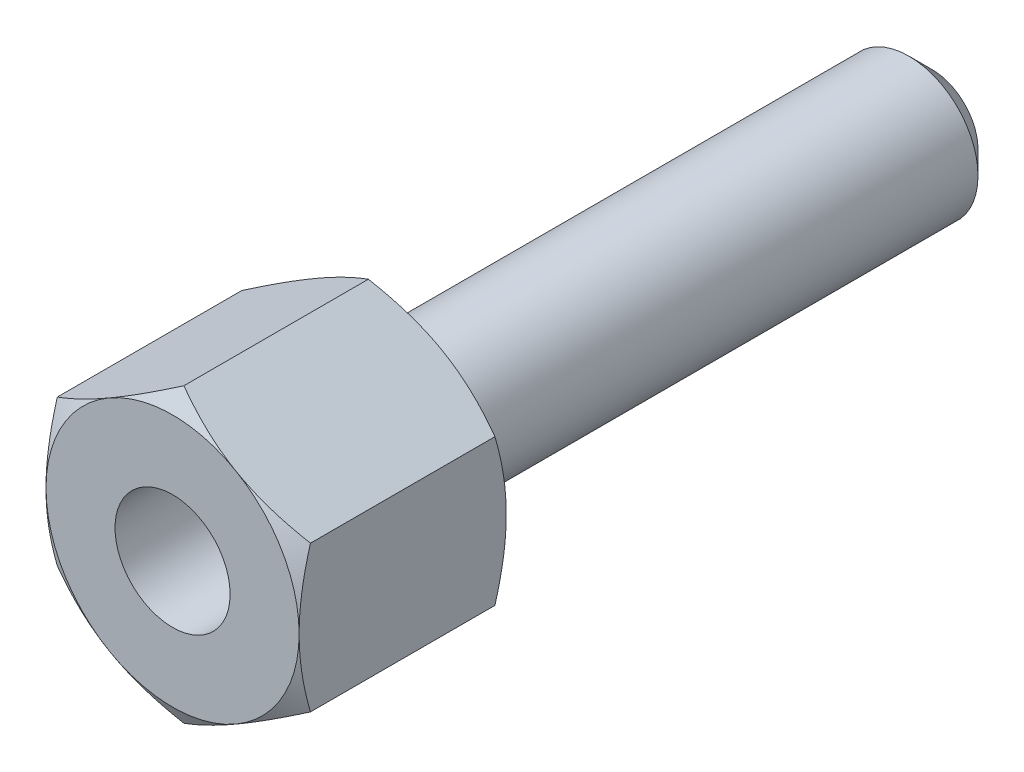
ISO-10303-21;
HEADER;
FILE_DESCRIPTION(('STEP AP214'),'2;1');
FILE_NAME('part.step','',(''),(''),'','','');
FILE_SCHEMA(('AUTOMOTIVE_DESIGN { 1 0 10303 214 1 1 1 1 }'));
ENDSEC;
DATA;
#1=APPLICATION_CONTEXT('core data for automotive mechanical design processes');
#2=APPLICATION_PROTOCOL_DEFINITION('international standard','automotive_design',2000,#1);
#3=PRODUCT_CONTEXT('',#1,'mechanical');
#4=PRODUCT('Part','Part','',(#3));
#5=PRODUCT_RELATED_PRODUCT_CATEGORY('part','',(#4));
#6=PRODUCT_DEFINITION_FORMATION('','',#4);
#7=PRODUCT_DEFINITION_CONTEXT('part definition',#1,'design');
#8=PRODUCT_DEFINITION('design','',#6,#7);
#9=PRODUCT_DEFINITION_SHAPE('','',#8);
#10=(LENGTH_UNIT() NAMED_UNIT(*) SI_UNIT(.MILLI.,.METRE.));
#11=(NAMED_UNIT(*) PLANE_ANGLE_UNIT() SI_UNIT($,.RADIAN.));
#12=(NAMED_UNIT(*) SI_UNIT($,.STERADIAN.) SOLID_ANGLE_UNIT());
#13=UNCERTAINTY_MEASURE_WITH_UNIT(LENGTH_MEASURE(1.E-05),#10,'distance_accuracy_value','');
#14=(GEOMETRIC_REPRESENTATION_CONTEXT(3) GLOBAL_UNCERTAINTY_ASSIGNED_CONTEXT((#13)) GLOBAL_UNIT_ASSIGNED_CONTEXT((#10,
#11,#12)) REPRESENTATION_CONTEXT('',''));
#15=CARTESIAN_POINT('',(0.,0.,0.));
#16=DIRECTION('',(0.,0.,1.));
#17=DIRECTION('',(1.,0.,0.));
#18=AXIS2_PLACEMENT_3D('',#15,#16,#17);
#19=CARTESIAN_POINT('',(11.,-6.35085296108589,18.));
#20=DIRECTION('',(-1.,0.,0.));
#21=DIRECTION('',(0.,0.,1.));
#22=AXIS2_PLACEMENT_3D('',#19,#20,#21);
#23=PLANE('',#22);
#24=CARTESIAN_POINT('',(11.,-17.0756488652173,5.37629196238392));
#25=CARTESIAN_POINT('',(11.,-16.8353326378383,5.25965447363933));
#26=CARTESIAN_POINT('',(11.,-16.5947348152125,5.14359745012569));
#27=CARTESIAN_POINT('',(11.,-16.112917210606,4.91277578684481));
#28=CARTESIAN_POINT('',(11.,-15.8716974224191,4.7980111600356));
#29=CARTESIAN_POINT('',(11.,-15.1469529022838,4.45582289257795));
#30=CARTESIAN_POINT('',(11.,-14.6624138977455,4.23053936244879));
#31=CARTESIAN_POINT('',(11.,-13.6874699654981,3.78582985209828));
#32=CARTESIAN_POINT('',(11.,-13.1970474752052,3.56644228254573));
#33=CARTESIAN_POINT('',(11.,-12.2123072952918,3.13662191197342));
#34=CARTESIAN_POINT('',(11.,-11.7179897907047,2.92618868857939));
#35=CARTESIAN_POINT('',(11.,-10.7087976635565,2.51010110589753));
#36=CARTESIAN_POINT('',(11.,-10.1937707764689,2.30481413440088));
#37=CARTESIAN_POINT('',(11.,-9.15769444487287,1.90973648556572));
#38=CARTESIAN_POINT('',(11.,-8.63664433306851,1.71994754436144));
#39=CARTESIAN_POINT('',(11.,-7.5886787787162,1.36083798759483));
#40=CARTESIAN_POINT('',(11.,-7.0617775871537,1.1914761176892));
#41=CARTESIAN_POINT('',(11.,-6.00036808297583,0.878634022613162));
#42=CARTESIAN_POINT('',(11.,-5.46586221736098,0.735145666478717));
#43=CARTESIAN_POINT('',(11.,-4.65974627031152,0.544884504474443));
#44=CARTESIAN_POINT('',(11.,-4.39103609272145,0.485750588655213));
#45=CARTESIAN_POINT('',(11.,-3.85177657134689,0.376514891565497));
#46=CARTESIAN_POINT('',(11.,-3.58122726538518,0.326412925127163));
#47=CARTESIAN_POINT('',(11.,-3.03847555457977,0.236124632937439));
#48=CARTESIAN_POINT('',(11.,-2.76627317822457,0.195938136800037));
#49=CARTESIAN_POINT('',(11.,-2.22050177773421,0.126281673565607));
#50=CARTESIAN_POINT('',(11.,-1.94693280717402,0.0968112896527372));
#51=CARTESIAN_POINT('',(11.,-1.40239199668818,0.0495431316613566));
#52=CARTESIAN_POINT('',(11.,-1.13143306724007,0.031597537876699));
#53=CARTESIAN_POINT('',(11.,-0.588999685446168,0.00718173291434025));
#54=CARTESIAN_POINT('',(11.,-0.31752524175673,0.000711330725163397));
#55=CARTESIAN_POINT('',(11.,0.225456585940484,-0.00060010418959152));
#56=CARTESIAN_POINT('',(11.,0.496963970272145,0.00455898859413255));
#57=CARTESIAN_POINT('',(11.,1.03951918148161,0.026380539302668));
#58=CARTESIAN_POINT('',(11.,1.31056698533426,0.0430435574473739));
#59=CARTESIAN_POINT('',(11.,1.96135383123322,0.0965093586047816));
#60=CARTESIAN_POINT('',(11.,2.34065675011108,0.138735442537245));
#61=CARTESIAN_POINT('',(11.,3.09644148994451,0.243416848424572));
#62=CARTESIAN_POINT('',(11.,3.47292292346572,0.305874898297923));
#63=CARTESIAN_POINT('',(11.,4.59769776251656,0.520284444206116));
#64=CARTESIAN_POINT('',(11.,5.34091254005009,0.699233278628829));
#65=CARTESIAN_POINT('',(11.,6.45248613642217,1.00953791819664));
#66=CARTESIAN_POINT('',(11.,6.82660667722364,1.12143981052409));
#67=CARTESIAN_POINT('',(11.,7.57121266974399,1.35685428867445));
#68=CARTESIAN_POINT('',(11.,7.94169809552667,1.48036695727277));
#69=CARTESIAN_POINT('',(11.,8.67915388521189,1.73702174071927));
#70=CARTESIAN_POINT('',(11.,9.04612534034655,1.87016074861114));
#71=CARTESIAN_POINT('',(11.,9.77702505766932,2.14450246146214));
#72=CARTESIAN_POINT('',(11.,10.1409533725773,2.28570502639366));
#73=CARTESIAN_POINT('',(11.,11.0667675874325,2.65483102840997));
#74=CARTESIAN_POINT('',(11.,11.6267570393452,2.88750481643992));
#75=CARTESIAN_POINT('',(11.,12.7414587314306,3.365207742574));
#76=CARTESIAN_POINT('',(11.,13.296170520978,3.61023792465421));
#77=CARTESIAN_POINT('',(11.,14.4014324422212,4.10991707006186));
#78=CARTESIAN_POINT('',(11.,14.9519812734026,4.36456890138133));
#79=CARTESIAN_POINT('',(11.,16.0495309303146,4.88134280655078));
#80=CARTESIAN_POINT('',(11.,16.5965318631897,5.14346465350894));
#81=CARTESIAN_POINT('',(11.,17.6883745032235,5.67400461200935));
#82=CARTESIAN_POINT('',(11.,18.2332123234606,5.94243070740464));
#83=CARTESIAN_POINT('',(11.,19.3205002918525,6.48407680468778));
#84=CARTESIAN_POINT('',(11.,19.8629504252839,6.75729683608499));
#85=CARTESIAN_POINT('',(11.,20.9457713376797,7.3075919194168));
#86=CARTESIAN_POINT('',(11.,21.4861424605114,7.58466629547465));
#87=CARTESIAN_POINT('',(11.,22.5652230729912,8.14203379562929));
#88=CARTESIAN_POINT('',(11.,23.1039325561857,8.42232693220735));
#89=CARTESIAN_POINT('',(11.,24.6148934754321,9.21324961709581));
#90=CARTESIAN_POINT('',(11.,25.5855608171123,9.72690499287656));
#91=CARTESIAN_POINT('',(11.,27.5235301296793,10.7606219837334));
#92=CARTESIAN_POINT('',(11.,28.490831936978,11.2806839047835));
#93=CARTESIAN_POINT('',(11.,30.4200227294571,12.3241238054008));
#94=CARTESIAN_POINT('',(11.,31.3819192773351,12.8474878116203));
#95=CARTESIAN_POINT('',(11.,32.823208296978,13.6353023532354));
#96=CARTESIAN_POINT('',(11.,33.3033631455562,13.8983600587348));
#97=CARTESIAN_POINT('',(11.,34.263217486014,14.4253034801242));
#98=CARTESIAN_POINT('',(11.,34.7429169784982,14.6891891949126));
#99=CARTESIAN_POINT('',(11.,35.2224158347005,14.9534390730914));
#100=B_SPLINE_CURVE_WITH_KNOTS('',3,(#24,#25,#26,#27,#28,#29,#30,#31,#32,#33,#34,#35,#36,#37,
#38,#39,#40,#41,#42,#43,#44,#45,#46,#47,#48,#49,#50,#51,#52,#53,#54,#55,#56,#57,#58,#59,#60,#61,
#62,#63,#64,#65,#66,#67,#68,#69,#70,#71,#72,#73,#74,#75,#76,#77,#78,#79,#80,#81,#82,#83,#84,#85,
#86,#87,#88,#89,#90,#91,#92,#93,#94,#95,#96,#97,#98,#99),.UNSPECIFIED.,.F.,.F.,(4,2,2,2,2,2,2,2,
2,2,2,2,2,2,2,2,2,2,2,2,2,2,2,2,2,2,2,2,2,2,2,2,2,2,2,2,2,4),(0.,0.801375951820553,
1.60275993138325,3.20576437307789,4.81746573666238,6.42909099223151,8.09219815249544,
9.75549136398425,11.4153670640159,13.0747202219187,13.9000127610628,14.7252883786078,
15.5505498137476,16.3757791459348,17.1902005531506,18.0046084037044,18.8190250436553,
19.6334813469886,20.7777737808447,21.9222205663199,24.2123414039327,25.3837356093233,
26.5551381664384,27.7261643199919,28.8971701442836,30.7161680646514,32.5353199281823,
34.3550183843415,36.1746616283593,37.9967488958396,39.818847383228,41.6406302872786,
43.4624202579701,46.7569746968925,50.0516870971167,53.3368536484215,54.9793305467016,
56.6218052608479),.UNSPECIFIED.);
#101=CARTESIAN_POINT('',(11.,6.35085296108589,0.982480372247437));
#102=VERTEX_POINT('',#101);
#103=CARTESIAN_POINT('',(11.,0.,0.));
#104=VERTEX_POINT('',#103);
#105=EDGE_CURVE('E102',#102,#104,#100,.F.);
#106=ORIENTED_EDGE('',*,*,#105,.F.);
#107=DIRECTION('',(0.,0.,-1.));
#108=VECTOR('',#107,1.);
#109=CARTESIAN_POINT('',(11.,6.35085296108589,18.));
#110=LINE('',#109,#108);
#111=CARTESIAN_POINT('',(11.,6.35085296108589,17.0175196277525));
#112=VERTEX_POINT('',#111);
#113=EDGE_CURVE('E323',#112,#102,#110,.T.);
#114=ORIENTED_EDGE('',*,*,#113,.F.);
#115=CARTESIAN_POINT('',(11.,-17.0756488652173,12.6237080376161));
#116=CARTESIAN_POINT('',(11.,-16.8353326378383,12.7403455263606));
#117=CARTESIAN_POINT('',(11.,-16.5947348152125,12.8564025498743));
#118=CARTESIAN_POINT('',(11.,-16.112917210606,13.0872242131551));
#119=CARTESIAN_POINT('',(11.,-15.8716974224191,13.2019888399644));
#120=CARTESIAN_POINT('',(11.,-15.1469529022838,13.544177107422));
#121=CARTESIAN_POINT('',(11.,-14.6624138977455,13.7694606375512));
#122=CARTESIAN_POINT('',(11.,-13.6874699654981,14.2141701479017));
#123=CARTESIAN_POINT('',(11.,-13.1970474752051,14.4335577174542));
#124=CARTESIAN_POINT('',(11.,-12.2123072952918,14.8633780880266));
#125=CARTESIAN_POINT('',(11.,-11.7179897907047,15.0738113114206));
#126=CARTESIAN_POINT('',(11.,-10.7087976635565,15.4898988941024));
#127=CARTESIAN_POINT('',(11.,-10.1937707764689,15.6951858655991));
#128=CARTESIAN_POINT('',(11.,-9.15769444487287,16.0902635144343));
#129=CARTESIAN_POINT('',(11.,-8.6366443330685,16.2800524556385));
#130=CARTESIAN_POINT('',(11.,-7.5886787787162,16.6391620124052));
#131=CARTESIAN_POINT('',(11.,-7.0617775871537,16.8085238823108));
#132=CARTESIAN_POINT('',(11.,-6.00036808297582,17.1213659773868));
#133=CARTESIAN_POINT('',(11.,-5.46586221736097,17.2648543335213));
#134=CARTESIAN_POINT('',(11.,-4.65974627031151,17.4551154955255));
#135=CARTESIAN_POINT('',(11.,-4.39103609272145,17.5142494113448));
#136=CARTESIAN_POINT('',(11.,-3.85177657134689,17.6234851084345));
#137=CARTESIAN_POINT('',(11.,-3.58122726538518,17.6735870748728));
#138=CARTESIAN_POINT('',(11.,-3.03847555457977,17.7638753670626));
#139=CARTESIAN_POINT('',(11.,-2.76627317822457,17.8040618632));
#140=CARTESIAN_POINT('',(11.,-2.2205017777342,17.8737183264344));
#141=CARTESIAN_POINT('',(11.,-1.94693280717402,17.9031887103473));
#142=CARTESIAN_POINT('',(11.,-1.40239199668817,17.9504568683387));
#143=CARTESIAN_POINT('',(11.,-1.13143306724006,17.9684024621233));
#144=CARTESIAN_POINT('',(11.,-0.588999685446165,17.9928182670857));
#145=CARTESIAN_POINT('',(11.,-0.317525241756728,17.9992886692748));
#146=CARTESIAN_POINT('',(11.,0.225456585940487,18.0006001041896));
#147=CARTESIAN_POINT('',(11.,0.496963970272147,17.9954410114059));
#148=CARTESIAN_POINT('',(11.,1.03951918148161,17.9736194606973));
#149=CARTESIAN_POINT('',(11.,1.31056698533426,17.9569564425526));
#150=CARTESIAN_POINT('',(11.,1.96135383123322,17.9034906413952));
#151=CARTESIAN_POINT('',(11.,2.34065675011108,17.8612645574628));
#152=CARTESIAN_POINT('',(11.,3.0964414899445,17.7565831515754));
#153=CARTESIAN_POINT('',(11.,3.47292292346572,17.6941251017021));
#154=CARTESIAN_POINT('',(11.,4.59769776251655,17.4797155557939));
#155=CARTESIAN_POINT('',(11.,5.34091254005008,17.3007667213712));
#156=CARTESIAN_POINT('',(11.,6.45248613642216,16.9904620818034));
#157=CARTESIAN_POINT('',(11.,6.82660667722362,16.8785601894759));
#158=CARTESIAN_POINT('',(11.,7.57121266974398,16.6431457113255));
#159=CARTESIAN_POINT('',(11.,7.94169809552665,16.5196330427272));
#160=CARTESIAN_POINT('',(11.,8.67915388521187,16.2629782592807));
#161=CARTESIAN_POINT('',(11.,9.04612534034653,16.1298392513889));
#162=CARTESIAN_POINT('',(11.,9.7770250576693,15.8554975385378));
#163=CARTESIAN_POINT('',(11.,10.1409533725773,15.7142949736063));
#164=CARTESIAN_POINT('',(11.,11.0667675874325,15.34516897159));
#165=CARTESIAN_POINT('',(11.,11.6267570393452,15.1124951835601));
#166=CARTESIAN_POINT('',(11.,12.7414587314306,14.634792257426));
#167=CARTESIAN_POINT('',(11.,13.296170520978,14.3897620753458));
#168=CARTESIAN_POINT('',(11.,14.4014324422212,13.8900829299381));
#169=CARTESIAN_POINT('',(11.,14.9519812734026,13.6354310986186));
#170=CARTESIAN_POINT('',(11.,16.0495309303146,13.1186571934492));
#171=CARTESIAN_POINT('',(11.,16.5965318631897,12.856535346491));
#172=CARTESIAN_POINT('',(11.,17.6883745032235,12.3259953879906));
#173=CARTESIAN_POINT('',(11.,18.2332123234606,12.0575692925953));
#174=CARTESIAN_POINT('',(11.,19.3205002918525,11.5159231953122));
#175=CARTESIAN_POINT('',(11.,19.8629504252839,11.2427031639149));
#176=CARTESIAN_POINT('',(11.,20.9457713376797,10.6924080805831));
#177=CARTESIAN_POINT('',(11.,21.4861424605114,10.4153337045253));
#178=CARTESIAN_POINT('',(11.,22.5652230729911,9.85796620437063));
#179=CARTESIAN_POINT('',(11.,23.1039325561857,9.57767306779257));
#180=CARTESIAN_POINT('',(11.,24.6148934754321,8.7867503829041));
#181=CARTESIAN_POINT('',(11.,25.5855608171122,8.27309500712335));
#182=CARTESIAN_POINT('',(11.,27.5235301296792,7.23937801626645));
#183=CARTESIAN_POINT('',(11.,28.4908319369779,6.71931609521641));
#184=CARTESIAN_POINT('',(11.,30.420022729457,5.67587619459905));
#185=CARTESIAN_POINT('',(11.,31.3819192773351,5.15251218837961));
#186=CARTESIAN_POINT('',(11.,32.823208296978,4.36469764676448));
#187=CARTESIAN_POINT('',(11.,33.3033631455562,4.10163994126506));
#188=CARTESIAN_POINT('',(11.,34.2632174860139,3.57469651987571));
#189=CARTESIAN_POINT('',(11.,34.7429169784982,3.31081080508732));
#190=CARTESIAN_POINT('',(11.,35.2224158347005,3.04656092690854));
#191=B_SPLINE_CURVE_WITH_KNOTS('',3,(#115,#116,#117,#118,#119,#120,#121,#122,#123,#124,#125,
#126,#127,#128,#129,#130,#131,#132,#133,#134,#135,#136,#137,#138,#139,#140,#141,#142,#143,#144,
#145,#146,#147,#148,#149,#150,#151,#152,#153,#154,#155,#156,#157,#158,#159,#160,#161,#162,#163,
#164,#165,#166,#167,#168,#169,#170,#171,#172,#173,#174,#175,#176,#177,#178,#179,#180,#181,#182,
#183,#184,#185,#186,#187,#188,#189,#190),.UNSPECIFIED.,.F.,.F.,(4,2,2,2,2,2,2,2,2,2,2,2,2,2,2,2,
2,2,2,2,2,2,2,2,2,2,2,2,2,2,2,2,2,2,2,2,2,4),(0.,0.80137595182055,1.60275993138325,
3.20576437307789,4.81746573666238,6.42909099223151,8.09219815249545,9.75549136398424,
11.4153670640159,13.0747202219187,13.9000127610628,14.7252883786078,15.5505498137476,
16.3757791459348,17.1902005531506,18.0046084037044,18.8190250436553,19.6334813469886,
20.7777737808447,21.9222205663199,24.2123414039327,25.3837356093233,26.5551381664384,
27.7261643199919,28.8971701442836,30.7161680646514,32.5353199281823,34.3550183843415,
36.1746616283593,37.9967488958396,39.818847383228,41.6406302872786,43.4624202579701,
46.7569746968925,50.0516870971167,53.3368536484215,54.9793305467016,56.6218052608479),.UNSPECIFIED.);
#192=CARTESIAN_POINT('',(11.,0.,18.));
#193=VERTEX_POINT('',#192);
#194=EDGE_CURVE('E162',#193,#112,#191,.T.);
#195=ORIENTED_EDGE('',*,*,#194,.F.);
#196=CARTESIAN_POINT('',(11.,-6.35085296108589,17.0175196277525));
#197=VERTEX_POINT('',#196);
#198=EDGE_CURVE('E169',#197,#193,#191,.T.);
#199=ORIENTED_EDGE('',*,*,#198,.F.);
#200=DIRECTION('',(0.,0.,-1.));
#201=VECTOR('',#200,1.);
#202=CARTESIAN_POINT('',(11.,-6.35085296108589,18.));
#203=LINE('',#202,#201);
#204=CARTESIAN_POINT('',(11.,-6.35085296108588,0.982480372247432));
#205=VERTEX_POINT('',#204);
#206=EDGE_CURVE('E131',#197,#205,#203,.T.);
#207=ORIENTED_EDGE('',*,*,#206,.T.);
#208=EDGE_CURVE('E113',#104,#205,#100,.F.);
#209=ORIENTED_EDGE('',*,*,#208,.F.);
#210=EDGE_LOOP('',(#106,#114,#195,#199,#207,#209));
#211=FACE_BOUND('',#210,.T.);
#212=ADVANCED_FACE('F14',(#211),#23,.F.);
#213=CARTESIAN_POINT('',(11.,6.35085296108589,18.));
#214=DIRECTION('',(-0.5,-0.866025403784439,0.));
#215=DIRECTION('',(0.866025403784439,-0.5,0.));
#216=AXIS2_PLACEMENT_3D('',#213,#214,#215);
#217=PLANE('',#216);
#218=CARTESIAN_POINT('',(-0.0002,12.7018213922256,0.982547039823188));
#219=CARTESIAN_POINT('',(0.241603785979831,12.5622159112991,0.901959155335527));
#220=CARTESIAN_POINT('',(0.484309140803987,12.4220899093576,0.825028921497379));
#221=CARTESIAN_POINT('',(0.971666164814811,12.1407142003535,0.679498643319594));
#222=CARTESIAN_POINT('',(1.21631844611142,11.999464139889,0.610901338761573));
#223=CARTESIAN_POINT('',(1.9542173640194,11.5734380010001,0.4189363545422));
#224=CARTESIAN_POINT('',(2.45037695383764,11.2869801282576,0.309747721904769));
#225=CARTESIAN_POINT('',(3.19285703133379,10.8583090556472,0.181714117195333));
#226=CARTESIAN_POINT('',(3.43695934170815,10.7173765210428,0.145242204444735));
#227=CARTESIAN_POINT('',(3.92629418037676,10.4348589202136,0.0840813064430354));
#228=CARTESIAN_POINT('',(4.17152673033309,10.2932738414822,0.0593925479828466));
#229=CARTESIAN_POINT('',(4.66240068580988,10.0098676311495,0.0224303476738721));
#230=CARTESIAN_POINT('',(4.90804125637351,9.86804698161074,0.0101421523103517));
#231=CARTESIAN_POINT('',(5.39955001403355,9.58427426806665,-0.00175707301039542));
#232=CARTESIAN_POINT('',(5.64541819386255,9.44232220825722,-0.00136849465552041));
#233=CARTESIAN_POINT('',(6.10507018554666,9.17694200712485,0.0112011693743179));
#234=CARTESIAN_POINT('',(6.31888677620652,9.05349494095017,0.0218490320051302));
#235=CARTESIAN_POINT('',(6.74602818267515,8.80688473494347,0.052531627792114));
#236=CARTESIAN_POINT('',(6.95935296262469,8.68372161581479,0.0725670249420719));
#237=CARTESIAN_POINT('',(7.3853948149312,8.43774623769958,0.121675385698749));
#238=CARTESIAN_POINT('',(7.5981112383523,8.31493435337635,0.150755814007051));
#239=CARTESIAN_POINT('',(8.02254681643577,8.0698863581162,0.21744399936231));
#240=CARTESIAN_POINT('',(8.23426590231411,7.94765028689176,0.255052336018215));
#241=CARTESIAN_POINT('',(8.87695113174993,7.5765957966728,0.381619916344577));
#242=CARTESIAN_POINT('',(9.30605612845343,7.32885191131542,0.483199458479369));
#243=CARTESIAN_POINT('',(10.1578675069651,6.83705838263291,0.713743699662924));
#244=CARTESIAN_POINT('',(10.580584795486,6.59300244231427,0.842654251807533));
#245=CARTESIAN_POINT('',(11.0002,6.35073749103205,0.982547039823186));
#246=B_SPLINE_CURVE_WITH_KNOTS('',3,(#218,#219,#220,#221,#222,#223,#224,#225,#226,#227,#228,
#229,#230,#231,#232,#233,#234,#235,#236,#237,#238,#239,#240,#241,#242,#243,#244,#245),
.UNSPECIFIED.,.F.,.F.,(4,2,2,2,2,2,2,2,2,2,2,2,2,4),(0.,0.871755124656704,1.74379610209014,
3.49159027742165,4.34403665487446,5.19649943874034,6.04794680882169,6.89936787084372,
7.64056020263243,8.38180496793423,9.12366309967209,9.86557166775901,11.3820155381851,
12.8954827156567),.UNSPECIFIED.);
#247=CARTESIAN_POINT('',(0.,12.7017059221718,0.982480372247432));
#248=VERTEX_POINT('',#247);
#249=CARTESIAN_POINT('',(5.5,9.52627944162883,0.));
#250=VERTEX_POINT('',#249);
#251=EDGE_CURVE('E132',#248,#250,#246,.T.);
#252=ORIENTED_EDGE('',*,*,#251,.F.);
#253=DIRECTION('',(0.,0.,-1.));
#254=VECTOR('',#253,1.);
#255=CARTESIAN_POINT('',(0.,12.7017059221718,18.));
#256=LINE('',#255,#254);
#257=CARTESIAN_POINT('',(0.,12.7017059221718,17.0175196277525));
#258=VERTEX_POINT('',#257);
#259=EDGE_CURVE('E270',#258,#248,#256,.T.);
#260=ORIENTED_EDGE('',*,*,#259,.F.);
#261=CARTESIAN_POINT('',(11.0002,6.35073749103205,17.0174529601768));
#262=CARTESIAN_POINT('',(10.7583962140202,6.49034297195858,17.0980408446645));
#263=CARTESIAN_POINT('',(10.515690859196,6.63046897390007,17.1749710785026));
#264=CARTESIAN_POINT('',(10.0283338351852,6.91184468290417,17.3205013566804));
#265=CARTESIAN_POINT('',(9.78368155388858,7.05309474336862,17.3890986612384));
#266=CARTESIAN_POINT('',(9.0457826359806,7.47912088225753,17.5810636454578));
#267=CARTESIAN_POINT('',(8.54962304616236,7.76557875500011,17.6902522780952));
#268=CARTESIAN_POINT('',(7.80714296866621,8.19424982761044,17.8182858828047));
#269=CARTESIAN_POINT('',(7.56304065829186,8.33518236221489,17.8547577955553));
#270=CARTESIAN_POINT('',(7.07370581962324,8.61769996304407,17.915918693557));
#271=CARTESIAN_POINT('',(6.82847326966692,8.75928504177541,17.9406074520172));
#272=CARTESIAN_POINT('',(6.33759931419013,9.04269125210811,17.9775696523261));
#273=CARTESIAN_POINT('',(6.0919587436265,9.18451190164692,17.9898578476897));
#274=CARTESIAN_POINT('',(5.60044998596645,9.46828461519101,18.0017570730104));
#275=CARTESIAN_POINT('',(5.35458180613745,9.61023667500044,18.0013684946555));
#276=CARTESIAN_POINT('',(4.89492981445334,9.87561687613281,17.9887988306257));
#277=CARTESIAN_POINT('',(4.68111322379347,9.99906394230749,17.9781509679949));
#278=CARTESIAN_POINT('',(4.25397181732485,10.2456741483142,17.9474683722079));
#279=CARTESIAN_POINT('',(4.04064703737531,10.3688372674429,17.9274329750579));
#280=CARTESIAN_POINT('',(3.6146051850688,10.6148126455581,17.8783246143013));
#281=CARTESIAN_POINT('',(3.4018887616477,10.7376245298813,17.849244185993));
#282=CARTESIAN_POINT('',(2.97745318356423,10.9826725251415,17.7825560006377));
#283=CARTESIAN_POINT('',(2.76573409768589,11.1049085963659,17.7449476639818));
#284=CARTESIAN_POINT('',(2.12304886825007,11.4759630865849,17.6183800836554));
#285=CARTESIAN_POINT('',(1.69394387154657,11.7237069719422,17.5168005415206));
#286=CARTESIAN_POINT('',(0.842132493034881,12.2155005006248,17.2862563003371));
#287=CARTESIAN_POINT('',(0.419415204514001,12.4595564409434,17.1573457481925));
#288=CARTESIAN_POINT('',(-0.000199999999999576,12.7018213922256,17.0174529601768));
#289=B_SPLINE_CURVE_WITH_KNOTS('',3,(#261,#262,#263,#264,#265,#266,#267,#268,#269,#270,#271,
#272,#273,#274,#275,#276,#277,#278,#279,#280,#281,#282,#283,#284,#285,#286,#287,#288),
.UNSPECIFIED.,.F.,.F.,(4,2,2,2,2,2,2,2,2,2,2,2,2,4),(0.,0.871755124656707,1.74379610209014,
3.49159027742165,4.34403665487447,5.19649943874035,6.0479468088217,6.89936787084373,
7.64056020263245,8.38180496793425,9.1236630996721,9.86557166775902,11.3820155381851,
12.8954827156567),.UNSPECIFIED.);
#290=CARTESIAN_POINT('',(5.5,9.52627944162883,18.));
#291=VERTEX_POINT('',#290);
#292=EDGE_CURVE('E171',#291,#258,#289,.T.);
#293=ORIENTED_EDGE('',*,*,#292,.F.);
#294=EDGE_CURVE('E170',#112,#291,#289,.T.);
#295=ORIENTED_EDGE('',*,*,#294,.F.);
#296=ORIENTED_EDGE('',*,*,#113,.T.);
#297=EDGE_CURVE('E108',#250,#102,#246,.T.);
#298=ORIENTED_EDGE('',*,*,#297,.F.);
#299=EDGE_LOOP('',(#252,#260,#293,#295,#296,#298));
#300=FACE_BOUND('',#299,.T.);
#301=ADVANCED_FACE('F154',(#300),#217,.F.);
#302=CARTESIAN_POINT('',(0.,-12.7017059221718,18.));
#303=DIRECTION('',(-0.5,0.866025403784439,0.));
#304=DIRECTION('',(-0.866025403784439,-0.5,0.));
#305=AXIS2_PLACEMENT_3D('',#302,#303,#304);
#306=PLANE('',#305);
#307=CARTESIAN_POINT('',(11.0002,-6.35073749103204,0.982547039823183));
#308=CARTESIAN_POINT('',(10.7583962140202,-6.49034297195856,0.901959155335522));
#309=CARTESIAN_POINT('',(10.515690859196,-6.63046897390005,0.825028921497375));
#310=CARTESIAN_POINT('',(10.0283338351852,-6.91184468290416,0.67949864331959));
#311=CARTESIAN_POINT('',(9.78368155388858,-7.05309474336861,0.610901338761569));
#312=CARTESIAN_POINT('',(9.0457826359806,-7.47912088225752,0.418936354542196));
#313=CARTESIAN_POINT('',(8.54962304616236,-7.76557875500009,0.309747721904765));
#314=CARTESIAN_POINT('',(7.80714296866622,-8.19424982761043,0.181714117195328));
#315=CARTESIAN_POINT('',(7.56304065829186,-8.33518236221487,0.145242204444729));
#316=CARTESIAN_POINT('',(7.07370581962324,-8.61769996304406,0.0840813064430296));
#317=CARTESIAN_POINT('',(6.82847326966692,-8.7592850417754,0.059392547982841));
#318=CARTESIAN_POINT('',(6.33759931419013,-9.0426912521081,0.0224303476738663));
#319=CARTESIAN_POINT('',(6.09195874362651,-9.1845119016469,0.0101421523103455));
#320=CARTESIAN_POINT('',(5.60044998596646,-9.46828461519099,-0.00175707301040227));
#321=CARTESIAN_POINT('',(5.35458180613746,-9.61023667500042,-0.0013684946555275));
#322=CARTESIAN_POINT('',(4.89492981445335,-9.8756168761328,0.0112011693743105));
#323=CARTESIAN_POINT('',(4.68111322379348,-9.99906394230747,0.0218490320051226));
#324=CARTESIAN_POINT('',(4.25397181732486,-10.2456741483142,0.052531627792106));
#325=CARTESIAN_POINT('',(4.04064703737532,-10.3688372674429,0.0725670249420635));
#326=CARTESIAN_POINT('',(3.61460518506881,-10.6148126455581,0.121675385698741));
#327=CARTESIAN_POINT('',(3.40188876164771,-10.7376245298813,0.150755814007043));
#328=CARTESIAN_POINT('',(2.97745318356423,-10.9826725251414,0.217443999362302));
#329=CARTESIAN_POINT('',(2.76573409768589,-11.1049085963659,0.255052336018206));
#330=CARTESIAN_POINT('',(2.12304886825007,-11.4759630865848,0.381619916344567));
#331=CARTESIAN_POINT('',(1.69394387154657,-11.7237069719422,0.483199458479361));
#332=CARTESIAN_POINT('',(0.842132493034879,-12.2155005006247,0.71374369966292));
#333=CARTESIAN_POINT('',(0.419415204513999,-12.4595564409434,0.84265425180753));
#334=CARTESIAN_POINT('',(-0.000200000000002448,-12.7018213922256,0.982547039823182));
#335=B_SPLINE_CURVE_WITH_KNOTS('',3,(#307,#308,#309,#310,#311,#312,#313,#314,#315,#316,#317,
#318,#319,#320,#321,#322,#323,#324,#325,#326,#327,#328,#329,#330,#331,#332,#333,#334),
.UNSPECIFIED.,.F.,.F.,(4,2,2,2,2,2,2,2,2,2,2,2,2,4),(0.,0.871755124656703,1.74379610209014,
3.49159027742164,4.34403665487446,5.19649943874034,6.04794680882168,6.89936787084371,
7.64056020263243,8.38180496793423,9.12366309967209,9.86557166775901,11.3820155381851,
12.8954827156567),.UNSPECIFIED.);
#336=CARTESIAN_POINT('',(5.5,-9.52627944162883,0.));
#337=VERTEX_POINT('',#336);
#338=EDGE_CURVE('E120',#205,#337,#335,.T.);
#339=ORIENTED_EDGE('',*,*,#338,.F.);
#340=ORIENTED_EDGE('',*,*,#206,.F.);
#341=CARTESIAN_POINT('',(-0.000200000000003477,-12.7018213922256,17.0174529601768));
#342=CARTESIAN_POINT('',(0.241603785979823,-12.5622159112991,17.0980408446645));
#343=CARTESIAN_POINT('',(0.484309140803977,-12.4220899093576,17.1749710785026));
#344=CARTESIAN_POINT('',(0.971666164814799,-12.1407142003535,17.3205013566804));
#345=CARTESIAN_POINT('',(1.21631844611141,-11.999464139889,17.3890986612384));
#346=CARTESIAN_POINT('',(1.95421736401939,-11.5734380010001,17.5810636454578));
#347=CARTESIAN_POINT('',(2.45037695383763,-11.2869801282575,17.6902522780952));
#348=CARTESIAN_POINT('',(3.19285703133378,-10.8583090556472,17.8182858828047));
#349=CARTESIAN_POINT('',(3.43695934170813,-10.7173765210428,17.8547577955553));
#350=CARTESIAN_POINT('',(3.92629418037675,-10.4348589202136,17.915918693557));
#351=CARTESIAN_POINT('',(4.17152673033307,-10.2932738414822,17.9406074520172));
#352=CARTESIAN_POINT('',(4.66240068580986,-10.0098676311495,17.9775696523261));
#353=CARTESIAN_POINT('',(4.90804125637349,-9.86804698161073,17.9898578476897));
#354=CARTESIAN_POINT('',(5.39955001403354,-9.58427426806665,18.0017570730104));
#355=CARTESIAN_POINT('',(5.64541819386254,-9.44232220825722,18.0013684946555));
#356=CARTESIAN_POINT('',(6.10507018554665,-9.17694200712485,17.9887988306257));
#357=CARTESIAN_POINT('',(6.31888677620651,-9.05349494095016,17.9781509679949));
#358=CARTESIAN_POINT('',(6.74602818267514,-8.80688473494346,17.9474683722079));
#359=CARTESIAN_POINT('',(6.95935296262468,-8.68372161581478,17.9274329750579));
#360=CARTESIAN_POINT('',(7.38539481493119,-8.43774623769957,17.8783246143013));
#361=CARTESIAN_POINT('',(7.59811123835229,-8.31493435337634,17.849244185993));
#362=CARTESIAN_POINT('',(8.02254681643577,-8.06988635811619,17.7825560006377));
#363=CARTESIAN_POINT('',(8.2342659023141,-7.94765028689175,17.7449476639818));
#364=CARTESIAN_POINT('',(8.87695113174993,-7.57659579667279,17.6183800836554));
#365=CARTESIAN_POINT('',(9.30605612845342,-7.32885191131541,17.5168005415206));
#366=CARTESIAN_POINT('',(10.1578675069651,-6.8370583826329,17.2862563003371));
#367=CARTESIAN_POINT('',(10.580584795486,-6.59300244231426,17.1573457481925));
#368=CARTESIAN_POINT('',(11.0002,-6.35073749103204,17.0174529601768));
#369=B_SPLINE_CURVE_WITH_KNOTS('',3,(#341,#342,#343,#344,#345,#346,#347,#348,#349,#350,#351,
#352,#353,#354,#355,#356,#357,#358,#359,#360,#361,#362,#363,#364,#365,#366,#367,#368),
.UNSPECIFIED.,.F.,.F.,(4,2,2,2,2,2,2,2,2,2,2,2,2,4),(0.,0.871755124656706,1.74379610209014,
3.49159027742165,4.34403665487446,5.19649943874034,6.04794680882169,6.89936787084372,
7.64056020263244,8.38180496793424,9.1236630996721,9.86557166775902,11.3820155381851,
12.8954827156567),.UNSPECIFIED.);
#370=CARTESIAN_POINT('',(5.5,-9.52627944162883,18.));
#371=VERTEX_POINT('',#370);
#372=EDGE_CURVE('E304',#371,#197,#369,.T.);
#373=ORIENTED_EDGE('',*,*,#372,.F.);
#374=CARTESIAN_POINT('',(0.,-12.7017059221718,17.0175196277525));
#375=VERTEX_POINT('',#374);
#376=EDGE_CURVE('E310',#375,#371,#369,.T.);
#377=ORIENTED_EDGE('',*,*,#376,.F.);
#378=DIRECTION('',(0.,0.,-1.));
#379=VECTOR('',#378,1.);
#380=CARTESIAN_POINT('',(0.,-12.7017059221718,18.));
#381=LINE('',#380,#379);
#382=CARTESIAN_POINT('',(0.,-12.7017059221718,0.982480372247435));
#383=VERTEX_POINT('',#382);
#384=EDGE_CURVE('E267',#375,#383,#381,.T.);
#385=ORIENTED_EDGE('',*,*,#384,.T.);
#386=EDGE_CURVE('E241',#337,#383,#335,.T.);
#387=ORIENTED_EDGE('',*,*,#386,.F.);
#388=EDGE_LOOP('',(#339,#340,#373,#377,#385,#387));
#389=FACE_BOUND('',#388,.T.);
#390=ADVANCED_FACE('F157',(#389),#306,.F.);
#391=CARTESIAN_POINT('',(-11.,-6.35085296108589,18.));
#392=DIRECTION('',(0.5,0.866025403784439,0.));
#393=DIRECTION('',(-0.866025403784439,0.5,0.));
#394=AXIS2_PLACEMENT_3D('',#391,#392,#393);
#395=PLANE('',#394);
#396=CARTESIAN_POINT('',(0.000199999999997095,-12.7018213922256,0.982547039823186));
#397=CARTESIAN_POINT('',(-0.241603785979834,-12.5622159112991,0.901959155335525));
#398=CARTESIAN_POINT('',(-0.48430914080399,-12.4220899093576,0.825028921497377));
#399=CARTESIAN_POINT('',(-0.971666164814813,-12.1407142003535,0.679498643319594));
#400=CARTESIAN_POINT('',(-1.21631844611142,-11.999464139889,0.610901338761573));
#401=CARTESIAN_POINT('',(-1.9542173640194,-11.5734380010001,0.418936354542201));
#402=CARTESIAN_POINT('',(-2.45037695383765,-11.2869801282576,0.30974772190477));
#403=CARTESIAN_POINT('',(-3.19285703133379,-10.8583090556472,0.181714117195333));
#404=CARTESIAN_POINT('',(-3.43695934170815,-10.7173765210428,0.145242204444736));
#405=CARTESIAN_POINT('',(-3.92629418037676,-10.4348589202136,0.084081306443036));
#406=CARTESIAN_POINT('',(-4.17152673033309,-10.2932738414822,0.0593925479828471));
#407=CARTESIAN_POINT('',(-4.66240068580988,-10.0098676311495,0.0224303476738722));
#408=CARTESIAN_POINT('',(-4.90804125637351,-9.86804698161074,0.0101421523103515));
#409=CARTESIAN_POINT('',(-5.39955001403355,-9.58427426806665,-0.0017570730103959));
#410=CARTESIAN_POINT('',(-5.64541819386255,-9.44232220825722,-0.00136849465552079));
#411=CARTESIAN_POINT('',(-6.10507018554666,-9.17694200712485,0.0112011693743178));
#412=CARTESIAN_POINT('',(-6.31888677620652,-9.05349494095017,0.0218490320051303));
#413=CARTESIAN_POINT('',(-6.74602818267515,-8.80688473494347,0.0525316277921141));
#414=CARTESIAN_POINT('',(-6.95935296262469,-8.68372161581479,0.0725670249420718));
#415=CARTESIAN_POINT('',(-7.3853948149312,-8.43774623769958,0.121675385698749));
#416=CARTESIAN_POINT('',(-7.5981112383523,-8.31493435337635,0.150755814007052));
#417=CARTESIAN_POINT('',(-8.02254681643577,-8.0698863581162,0.21744399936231));
#418=CARTESIAN_POINT('',(-8.23426590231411,-7.94765028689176,0.255052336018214));
#419=CARTESIAN_POINT('',(-8.87695113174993,-7.5765957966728,0.381619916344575));
#420=CARTESIAN_POINT('',(-9.30605612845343,-7.32885191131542,0.483199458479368));
#421=CARTESIAN_POINT('',(-10.1578675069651,-6.83705838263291,0.713743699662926));
#422=CARTESIAN_POINT('',(-10.580584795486,-6.59300244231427,0.842654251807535));
#423=CARTESIAN_POINT('',(-11.0002,-6.35073749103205,0.982547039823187));
#424=B_SPLINE_CURVE_WITH_KNOTS('',3,(#396,#397,#398,#399,#400,#401,#402,#403,#404,#405,#406,
#407,#408,#409,#410,#411,#412,#413,#414,#415,#416,#417,#418,#419,#420,#421,#422,#423),
.UNSPECIFIED.,.F.,.F.,(4,2,2,2,2,2,2,2,2,2,2,2,2,4),(0.,0.871755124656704,1.74379610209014,
3.49159027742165,4.34403665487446,5.19649943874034,6.04794680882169,6.89936787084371,
7.64056020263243,8.38180496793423,9.12366309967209,9.86557166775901,11.3820155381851,
12.8954827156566),.UNSPECIFIED.);
#425=CARTESIAN_POINT('',(-5.5,-9.52627944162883,0.));
#426=VERTEX_POINT('',#425);
#427=EDGE_CURVE('E240',#383,#426,#424,.T.);
#428=ORIENTED_EDGE('',*,*,#427,.F.);
#429=ORIENTED_EDGE('',*,*,#384,.F.);
#430=CARTESIAN_POINT('',(-11.0002,-6.35073749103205,17.0174529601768));
#431=CARTESIAN_POINT('',(-10.7583962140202,-6.49034297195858,17.0980408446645));
#432=CARTESIAN_POINT('',(-10.515690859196,-6.63046897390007,17.1749710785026));
#433=CARTESIAN_POINT('',(-10.0283338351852,-6.91184468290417,17.3205013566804));
#434=CARTESIAN_POINT('',(-9.78368155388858,-7.05309474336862,17.3890986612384));
#435=CARTESIAN_POINT('',(-9.0457826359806,-7.47912088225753,17.5810636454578));
#436=CARTESIAN_POINT('',(-8.54962304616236,-7.76557875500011,17.6902522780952));
#437=CARTESIAN_POINT('',(-7.80714296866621,-8.19424982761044,17.8182858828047));
#438=CARTESIAN_POINT('',(-7.56304065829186,-8.33518236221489,17.8547577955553));
#439=CARTESIAN_POINT('',(-7.07370581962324,-8.61769996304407,17.915918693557));
#440=CARTESIAN_POINT('',(-6.82847326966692,-8.75928504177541,17.9406074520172));
#441=CARTESIAN_POINT('',(-6.33759931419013,-9.04269125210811,17.9775696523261));
#442=CARTESIAN_POINT('',(-6.0919587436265,-9.18451190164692,17.9898578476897));
#443=CARTESIAN_POINT('',(-5.60044998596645,-9.46828461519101,18.0017570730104));
#444=CARTESIAN_POINT('',(-5.35458180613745,-9.61023667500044,18.0013684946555));
#445=CARTESIAN_POINT('',(-4.89492981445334,-9.87561687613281,17.9887988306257));
#446=CARTESIAN_POINT('',(-4.68111322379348,-9.99906394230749,17.9781509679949));
#447=CARTESIAN_POINT('',(-4.25397181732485,-10.2456741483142,17.9474683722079));
#448=CARTESIAN_POINT('',(-4.04064703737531,-10.3688372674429,17.9274329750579));
#449=CARTESIAN_POINT('',(-3.6146051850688,-10.6148126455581,17.8783246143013));
#450=CARTESIAN_POINT('',(-3.4018887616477,-10.7376245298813,17.849244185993));
#451=CARTESIAN_POINT('',(-2.97745318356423,-10.9826725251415,17.7825560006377));
#452=CARTESIAN_POINT('',(-2.76573409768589,-11.1049085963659,17.7449476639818));
#453=CARTESIAN_POINT('',(-2.12304886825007,-11.4759630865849,17.6183800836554));
#454=CARTESIAN_POINT('',(-1.69394387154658,-11.7237069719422,17.5168005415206));
#455=CARTESIAN_POINT('',(-0.842132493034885,-12.2155005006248,17.2862563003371));
#456=CARTESIAN_POINT('',(-0.419415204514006,-12.4595564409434,17.1573457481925));
#457=CARTESIAN_POINT('',(0.000199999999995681,-12.7018213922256,17.0174529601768));
#458=B_SPLINE_CURVE_WITH_KNOTS('',3,(#430,#431,#432,#433,#434,#435,#436,#437,#438,#439,#440,
#441,#442,#443,#444,#445,#446,#447,#448,#449,#450,#451,#452,#453,#454,#455,#456,#457),
.UNSPECIFIED.,.F.,.F.,(4,2,2,2,2,2,2,2,2,2,2,2,2,4),(0.,0.871755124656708,1.74379610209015,
3.49159027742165,4.34403665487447,5.19649943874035,6.0479468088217,6.89936787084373,
7.64056020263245,8.38180496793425,9.1236630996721,9.86557166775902,11.3820155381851,
12.8954827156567),.UNSPECIFIED.);
#459=CARTESIAN_POINT('',(-5.5,-9.52627944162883,18.));
#460=VERTEX_POINT('',#459);
#461=EDGE_CURVE('E311',#460,#375,#458,.T.);
#462=ORIENTED_EDGE('',*,*,#461,.F.);
#463=CARTESIAN_POINT('',(-11.,-6.35085296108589,17.0175196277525));
#464=VERTEX_POINT('',#463);
#465=EDGE_CURVE('E177',#464,#460,#458,.T.);
#466=ORIENTED_EDGE('',*,*,#465,.F.);
#467=DIRECTION('',(0.,0.,-1.));
#468=VECTOR('',#467,1.);
#469=CARTESIAN_POINT('',(-11.,-6.35085296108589,18.));
#470=LINE('',#469,#468);
#471=CARTESIAN_POINT('',(-11.,-6.35085296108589,0.982480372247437));
#472=VERTEX_POINT('',#471);
#473=EDGE_CURVE('E262',#464,#472,#470,.T.);
#474=ORIENTED_EDGE('',*,*,#473,.T.);
#475=EDGE_CURVE('E235',#426,#472,#424,.T.);
#476=ORIENTED_EDGE('',*,*,#475,.F.);
#477=EDGE_LOOP('',(#428,#429,#462,#466,#474,#476));
#478=FACE_BOUND('',#477,.T.);
#479=ADVANCED_FACE('F216',(#478),#395,.F.);
#480=CARTESIAN_POINT('',(-11.,6.35085296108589,18.));
#481=DIRECTION('',(1.,0.,0.));
#482=DIRECTION('',(0.,0.,-1.));
#483=AXIS2_PLACEMENT_3D('',#480,#481,#482);
#484=PLANE('',#483);
#485=CARTESIAN_POINT('',(-11.,-17.0756488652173,5.37629196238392));
#486=CARTESIAN_POINT('',(-11.,-16.8353326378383,5.25965447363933));
#487=CARTESIAN_POINT('',(-11.,-16.5947348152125,5.14359745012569));
#488=CARTESIAN_POINT('',(-11.,-16.112917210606,4.91277578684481));
#489=CARTESIAN_POINT('',(-11.,-15.8716974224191,4.7980111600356));
#490=CARTESIAN_POINT('',(-11.,-15.1469529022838,4.45582289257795));
#491=CARTESIAN_POINT('',(-11.,-14.6624138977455,4.23053936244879));
#492=CARTESIAN_POINT('',(-11.,-13.6874699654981,3.78582985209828));
#493=CARTESIAN_POINT('',(-11.,-13.1970474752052,3.56644228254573));
#494=CARTESIAN_POINT('',(-11.,-12.2123072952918,3.13662191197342));
#495=CARTESIAN_POINT('',(-11.,-11.7179897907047,2.92618868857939));
#496=CARTESIAN_POINT('',(-11.,-10.7087976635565,2.51010110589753));
#497=CARTESIAN_POINT('',(-11.,-10.1937707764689,2.30481413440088));
#498=CARTESIAN_POINT('',(-11.,-9.15769444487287,1.90973648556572));
#499=CARTESIAN_POINT('',(-11.,-8.63664433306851,1.71994754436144));
#500=CARTESIAN_POINT('',(-11.,-7.5886787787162,1.36083798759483));
#501=CARTESIAN_POINT('',(-11.,-7.0617775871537,1.1914761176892));
#502=CARTESIAN_POINT('',(-11.,-6.00036808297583,0.878634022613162));
#503=CARTESIAN_POINT('',(-11.,-5.46586221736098,0.735145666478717));
#504=CARTESIAN_POINT('',(-11.,-4.65974627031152,0.544884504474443));
#505=CARTESIAN_POINT('',(-11.,-4.39103609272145,0.485750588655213));
#506=CARTESIAN_POINT('',(-11.,-3.85177657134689,0.376514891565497));
#507=CARTESIAN_POINT('',(-11.,-3.58122726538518,0.326412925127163));
#508=CARTESIAN_POINT('',(-11.,-3.03847555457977,0.236124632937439));
#509=CARTESIAN_POINT('',(-11.,-2.76627317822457,0.195938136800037));
#510=CARTESIAN_POINT('',(-11.,-2.22050177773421,0.126281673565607));
#511=CARTESIAN_POINT('',(-11.,-1.94693280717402,0.0968112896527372));
#512=CARTESIAN_POINT('',(-11.,-1.40239199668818,0.0495431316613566));
#513=CARTESIAN_POINT('',(-11.,-1.13143306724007,0.031597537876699));
#514=CARTESIAN_POINT('',(-11.,-0.588999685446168,0.00718173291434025));
#515=CARTESIAN_POINT('',(-11.,-0.31752524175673,0.000711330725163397));
#516=CARTESIAN_POINT('',(-11.,0.225456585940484,-0.00060010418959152));
#517=CARTESIAN_POINT('',(-11.,0.496963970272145,0.00455898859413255));
#518=CARTESIAN_POINT('',(-11.,1.03951918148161,0.026380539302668));
#519=CARTESIAN_POINT('',(-11.,1.31056698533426,0.0430435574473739));
#520=CARTESIAN_POINT('',(-11.,1.96135383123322,0.0965093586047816));
#521=CARTESIAN_POINT('',(-11.,2.34065675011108,0.138735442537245));
#522=CARTESIAN_POINT('',(-11.,3.09644148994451,0.243416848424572));
#523=CARTESIAN_POINT('',(-11.,3.47292292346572,0.305874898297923));
#524=CARTESIAN_POINT('',(-11.,4.59769776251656,0.520284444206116));
#525=CARTESIAN_POINT('',(-11.,5.34091254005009,0.699233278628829));
#526=CARTESIAN_POINT('',(-11.,6.45248613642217,1.00953791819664));
#527=CARTESIAN_POINT('',(-11.,6.82660667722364,1.12143981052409));
#528=CARTESIAN_POINT('',(-11.,7.57121266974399,1.35685428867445));
#529=CARTESIAN_POINT('',(-11.,7.94169809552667,1.48036695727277));
#530=CARTESIAN_POINT('',(-11.,8.67915388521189,1.73702174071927));
#531=CARTESIAN_POINT('',(-11.,9.04612534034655,1.87016074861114));
#532=CARTESIAN_POINT('',(-11.,9.77702505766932,2.14450246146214));
#533=CARTESIAN_POINT('',(-11.,10.1409533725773,2.28570502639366));
#534=CARTESIAN_POINT('',(-11.,11.0667675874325,2.65483102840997));
#535=CARTESIAN_POINT('',(-11.,11.6267570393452,2.88750481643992));
#536=CARTESIAN_POINT('',(-11.,12.7414587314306,3.365207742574));
#537=CARTESIAN_POINT('',(-11.,13.296170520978,3.61023792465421));
#538=CARTESIAN_POINT('',(-11.,14.4014324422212,4.10991707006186));
#539=CARTESIAN_POINT('',(-11.,14.9519812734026,4.36456890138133));
#540=CARTESIAN_POINT('',(-11.,16.0495309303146,4.88134280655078));
#541=CARTESIAN_POINT('',(-11.,16.5965318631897,5.14346465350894));
#542=CARTESIAN_POINT('',(-11.,17.6883745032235,5.67400461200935));
#543=CARTESIAN_POINT('',(-11.,18.2332123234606,5.94243070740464));
#544=CARTESIAN_POINT('',(-11.,19.3205002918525,6.48407680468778));
#545=CARTESIAN_POINT('',(-11.,19.8629504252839,6.75729683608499));
#546=CARTESIAN_POINT('',(-11.,20.9457713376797,7.3075919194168));
#547=CARTESIAN_POINT('',(-11.,21.4861424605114,7.58466629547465));
#548=CARTESIAN_POINT('',(-11.,22.5652230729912,8.14203379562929));
#549=CARTESIAN_POINT('',(-11.,23.1039325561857,8.42232693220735));
#550=CARTESIAN_POINT('',(-11.,24.6148934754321,9.21324961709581));
#551=CARTESIAN_POINT('',(-11.,25.5855608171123,9.72690499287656));
#552=CARTESIAN_POINT('',(-11.,27.5235301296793,10.7606219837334));
#553=CARTESIAN_POINT('',(-11.,28.490831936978,11.2806839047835));
#554=CARTESIAN_POINT('',(-11.,30.4200227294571,12.3241238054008));
#555=CARTESIAN_POINT('',(-11.,31.3819192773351,12.8474878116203));
#556=CARTESIAN_POINT('',(-11.,32.823208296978,13.6353023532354));
#557=CARTESIAN_POINT('',(-11.,33.3033631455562,13.8983600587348));
#558=CARTESIAN_POINT('',(-11.,34.263217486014,14.4253034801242));
#559=CARTESIAN_POINT('',(-11.,34.7429169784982,14.6891891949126));
#560=CARTESIAN_POINT('',(-11.,35.2224158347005,14.9534390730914));
#561=B_SPLINE_CURVE_WITH_KNOTS('',3,(#485,#486,#487,#488,#489,#490,#491,#492,#493,#494,#495,
#496,#497,#498,#499,#500,#501,#502,#503,#504,#505,#506,#507,#508,#509,#510,#511,#512,#513,#514,
#515,#516,#517,#518,#519,#520,#521,#522,#523,#524,#525,#526,#527,#528,#529,#530,#531,#532,#533,
#534,#535,#536,#537,#538,#539,#540,#541,#542,#543,#544,#545,#546,#547,#548,#549,#550,#551,#552,
#553,#554,#555,#556,#557,#558,#559,#560),.UNSPECIFIED.,.F.,.F.,(4,2,2,2,2,2,2,2,2,2,2,2,2,2,2,2,
2,2,2,2,2,2,2,2,2,2,2,2,2,2,2,2,2,2,2,2,2,4),(0.,0.801375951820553,1.60275993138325,
3.20576437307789,4.81746573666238,6.42909099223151,8.09219815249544,9.75549136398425,
11.4153670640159,13.0747202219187,13.9000127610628,14.7252883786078,15.5505498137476,
16.3757791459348,17.1902005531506,18.0046084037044,18.8190250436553,19.6334813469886,
20.7777737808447,21.9222205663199,24.2123414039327,25.3837356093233,26.5551381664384,
27.7261643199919,28.8971701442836,30.7161680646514,32.5353199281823,34.3550183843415,
36.1746616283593,37.9967488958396,39.818847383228,41.6406302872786,43.4624202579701,
46.7569746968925,50.0516870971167,53.3368536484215,54.9793305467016,56.6218052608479),.UNSPECIFIED.);
#562=CARTESIAN_POINT('',(-11.,0.,0.));
#563=VERTEX_POINT('',#562);
#564=EDGE_CURVE('E229',#472,#563,#561,.T.);
#565=ORIENTED_EDGE('',*,*,#564,.F.);
#566=ORIENTED_EDGE('',*,*,#473,.F.);
#567=CARTESIAN_POINT('',(-11.,-17.0756488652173,12.6237080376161));
#568=CARTESIAN_POINT('',(-11.,-16.8353326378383,12.7403455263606));
#569=CARTESIAN_POINT('',(-11.,-16.5947348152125,12.8564025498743));
#570=CARTESIAN_POINT('',(-11.,-16.112917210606,13.0872242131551));
#571=CARTESIAN_POINT('',(-11.,-15.8716974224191,13.2019888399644));
#572=CARTESIAN_POINT('',(-11.,-15.1469529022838,13.544177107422));
#573=CARTESIAN_POINT('',(-11.,-14.6624138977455,13.7694606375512));
#574=CARTESIAN_POINT('',(-11.,-13.6874699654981,14.2141701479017));
#575=CARTESIAN_POINT('',(-11.,-13.1970474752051,14.4335577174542));
#576=CARTESIAN_POINT('',(-11.,-12.2123072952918,14.8633780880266));
#577=CARTESIAN_POINT('',(-11.,-11.7179897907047,15.0738113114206));
#578=CARTESIAN_POINT('',(-11.,-10.7087976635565,15.4898988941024));
#579=CARTESIAN_POINT('',(-11.,-10.1937707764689,15.6951858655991));
#580=CARTESIAN_POINT('',(-11.,-9.15769444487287,16.0902635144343));
#581=CARTESIAN_POINT('',(-11.,-8.6366443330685,16.2800524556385));
#582=CARTESIAN_POINT('',(-11.,-7.5886787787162,16.6391620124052));
#583=CARTESIAN_POINT('',(-11.,-7.0617775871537,16.8085238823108));
#584=CARTESIAN_POINT('',(-11.,-6.00036808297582,17.1213659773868));
#585=CARTESIAN_POINT('',(-11.,-5.46586221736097,17.2648543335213));
#586=CARTESIAN_POINT('',(-11.,-4.65974627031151,17.4551154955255));
#587=CARTESIAN_POINT('',(-11.,-4.39103609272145,17.5142494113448));
#588=CARTESIAN_POINT('',(-11.,-3.85177657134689,17.6234851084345));
#589=CARTESIAN_POINT('',(-11.,-3.58122726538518,17.6735870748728));
#590=CARTESIAN_POINT('',(-11.,-3.03847555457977,17.7638753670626));
#591=CARTESIAN_POINT('',(-11.,-2.76627317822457,17.8040618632));
#592=CARTESIAN_POINT('',(-11.,-2.2205017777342,17.8737183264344));
#593=CARTESIAN_POINT('',(-11.,-1.94693280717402,17.9031887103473));
#594=CARTESIAN_POINT('',(-11.,-1.40239199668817,17.9504568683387));
#595=CARTESIAN_POINT('',(-11.,-1.13143306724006,17.9684024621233));
#596=CARTESIAN_POINT('',(-11.,-0.588999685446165,17.9928182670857));
#597=CARTESIAN_POINT('',(-11.,-0.317525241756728,17.9992886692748));
#598=CARTESIAN_POINT('',(-11.,0.225456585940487,18.0006001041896));
#599=CARTESIAN_POINT('',(-11.,0.496963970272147,17.9954410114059));
#600=CARTESIAN_POINT('',(-11.,1.03951918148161,17.9736194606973));
#601=CARTESIAN_POINT('',(-11.,1.31056698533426,17.9569564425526));
#602=CARTESIAN_POINT('',(-11.,1.96135383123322,17.9034906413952));
#603=CARTESIAN_POINT('',(-11.,2.34065675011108,17.8612645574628));
#604=CARTESIAN_POINT('',(-11.,3.0964414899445,17.7565831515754));
#605=CARTESIAN_POINT('',(-11.,3.47292292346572,17.6941251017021));
#606=CARTESIAN_POINT('',(-11.,4.59769776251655,17.4797155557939));
#607=CARTESIAN_POINT('',(-11.,5.34091254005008,17.3007667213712));
#608=CARTESIAN_POINT('',(-11.,6.45248613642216,16.9904620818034));
#609=CARTESIAN_POINT('',(-11.,6.82660667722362,16.8785601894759));
#610=CARTESIAN_POINT('',(-11.,7.57121266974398,16.6431457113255));
#611=CARTESIAN_POINT('',(-11.,7.94169809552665,16.5196330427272));
#612=CARTESIAN_POINT('',(-11.,8.67915388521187,16.2629782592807));
#613=CARTESIAN_POINT('',(-11.,9.04612534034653,16.1298392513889));
#614=CARTESIAN_POINT('',(-11.,9.7770250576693,15.8554975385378));
#615=CARTESIAN_POINT('',(-11.,10.1409533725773,15.7142949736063));
#616=CARTESIAN_POINT('',(-11.,11.0667675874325,15.34516897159));
#617=CARTESIAN_POINT('',(-11.,11.6267570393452,15.1124951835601));
#618=CARTESIAN_POINT('',(-11.,12.7414587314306,14.634792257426));
#619=CARTESIAN_POINT('',(-11.,13.296170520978,14.3897620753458));
#620=CARTESIAN_POINT('',(-11.,14.4014324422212,13.8900829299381));
#621=CARTESIAN_POINT('',(-11.,14.9519812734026,13.6354310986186));
#622=CARTESIAN_POINT('',(-11.,16.0495309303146,13.1186571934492));
#623=CARTESIAN_POINT('',(-11.,16.5965318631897,12.856535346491));
#624=CARTESIAN_POINT('',(-11.,17.6883745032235,12.3259953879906));
#625=CARTESIAN_POINT('',(-11.,18.2332123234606,12.0575692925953));
#626=CARTESIAN_POINT('',(-11.,19.3205002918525,11.5159231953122));
#627=CARTESIAN_POINT('',(-11.,19.8629504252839,11.2427031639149));
#628=CARTESIAN_POINT('',(-11.,20.9457713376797,10.6924080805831));
#629=CARTESIAN_POINT('',(-11.,21.4861424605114,10.4153337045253));
#630=CARTESIAN_POINT('',(-11.,22.5652230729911,9.85796620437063));
#631=CARTESIAN_POINT('',(-11.,23.1039325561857,9.57767306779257));
#632=CARTESIAN_POINT('',(-11.,24.6148934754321,8.7867503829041));
#633=CARTESIAN_POINT('',(-11.,25.5855608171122,8.27309500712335));
#634=CARTESIAN_POINT('',(-11.,27.5235301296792,7.23937801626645));
#635=CARTESIAN_POINT('',(-11.,28.4908319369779,6.71931609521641));
#636=CARTESIAN_POINT('',(-11.,30.420022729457,5.67587619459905));
#637=CARTESIAN_POINT('',(-11.,31.3819192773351,5.15251218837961));
#638=CARTESIAN_POINT('',(-11.,32.823208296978,4.36469764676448));
#639=CARTESIAN_POINT('',(-11.,33.3033631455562,4.10163994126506));
#640=CARTESIAN_POINT('',(-11.,34.2632174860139,3.57469651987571));
#641=CARTESIAN_POINT('',(-11.,34.7429169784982,3.31081080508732));
#642=CARTESIAN_POINT('',(-11.,35.2224158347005,3.04656092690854));
#643=B_SPLINE_CURVE_WITH_KNOTS('',3,(#567,#568,#569,#570,#571,#572,#573,#574,#575,#576,#577,
#578,#579,#580,#581,#582,#583,#584,#585,#586,#587,#588,#589,#590,#591,#592,#593,#594,#595,#596,
#597,#598,#599,#600,#601,#602,#603,#604,#605,#606,#607,#608,#609,#610,#611,#612,#613,#614,#615,
#616,#617,#618,#619,#620,#621,#622,#623,#624,#625,#626,#627,#628,#629,#630,#631,#632,#633,#634,
#635,#636,#637,#638,#639,#640,#641,#642),.UNSPECIFIED.,.F.,.F.,(4,2,2,2,2,2,2,2,2,2,2,2,2,2,2,2,
2,2,2,2,2,2,2,2,2,2,2,2,2,2,2,2,2,2,2,2,2,4),(0.,0.80137595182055,1.60275993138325,
3.20576437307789,4.81746573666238,6.42909099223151,8.09219815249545,9.75549136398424,
11.4153670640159,13.0747202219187,13.9000127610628,14.7252883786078,15.5505498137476,
16.3757791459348,17.1902005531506,18.0046084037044,18.8190250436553,19.6334813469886,
20.7777737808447,21.9222205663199,24.2123414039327,25.3837356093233,26.5551381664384,
27.7261643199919,28.8971701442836,30.7161680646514,32.5353199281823,34.3550183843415,
36.1746616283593,37.9967488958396,39.818847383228,41.6406302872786,43.4624202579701,
46.7569746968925,50.0516870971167,53.3368536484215,54.9793305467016,56.6218052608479),.UNSPECIFIED.);
#644=CARTESIAN_POINT('',(-11.,0.,18.));
#645=VERTEX_POINT('',#644);
#646=EDGE_CURVE('E211',#645,#464,#643,.F.);
#647=ORIENTED_EDGE('',*,*,#646,.F.);
#648=CARTESIAN_POINT('',(-11.,6.35085296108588,17.0175196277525));
#649=VERTEX_POINT('',#648);
#650=EDGE_CURVE('E203',#649,#645,#643,.F.);
#651=ORIENTED_EDGE('',*,*,#650,.F.);
#652=DIRECTION('',(0.,0.,-1.));
#653=VECTOR('',#652,1.);
#654=CARTESIAN_POINT('',(-11.,6.35085296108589,18.));
#655=LINE('',#654,#653);
#656=CARTESIAN_POINT('',(-11.,6.35085296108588,0.982480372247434));
#657=VERTEX_POINT('',#656);
#658=EDGE_CURVE('E266',#649,#657,#655,.T.);
#659=ORIENTED_EDGE('',*,*,#658,.T.);
#660=EDGE_CURVE('E222',#563,#657,#561,.T.);
#661=ORIENTED_EDGE('',*,*,#660,.F.);
#662=EDGE_LOOP('',(#565,#566,#647,#651,#659,#661));
#663=FACE_BOUND('',#662,.T.);
#664=ADVANCED_FACE('F212',(#663),#484,.F.);
#665=CARTESIAN_POINT('',(0.,12.7017059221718,18.));
#666=DIRECTION('',(0.5,-0.866025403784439,0.));
#667=DIRECTION('',(0.866025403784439,0.5,0.));
#668=AXIS2_PLACEMENT_3D('',#665,#666,#667);
#669=PLANE('',#668);
#670=CARTESIAN_POINT('',(-11.0002,6.35073749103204,0.982547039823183));
#671=CARTESIAN_POINT('',(-10.7583962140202,6.49034297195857,0.901959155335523));
#672=CARTESIAN_POINT('',(-10.515690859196,6.63046897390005,0.825028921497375));
#673=CARTESIAN_POINT('',(-10.0283338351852,6.91184468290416,0.67949864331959));
#674=CARTESIAN_POINT('',(-9.78368155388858,7.05309474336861,0.610901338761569));
#675=CARTESIAN_POINT('',(-9.0457826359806,7.47912088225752,0.418936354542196));
#676=CARTESIAN_POINT('',(-8.54962304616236,7.7655787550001,0.309747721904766));
#677=CARTESIAN_POINT('',(-7.80714296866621,8.19424982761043,0.181714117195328));
#678=CARTESIAN_POINT('',(-7.56304065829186,8.33518236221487,0.145242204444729));
#679=CARTESIAN_POINT('',(-7.07370581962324,8.61769996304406,0.0840813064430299));
#680=CARTESIAN_POINT('',(-6.82847326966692,8.7592850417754,0.059392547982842));
#681=CARTESIAN_POINT('',(-6.33759931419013,9.0426912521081,0.0224303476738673));
#682=CARTESIAN_POINT('',(-6.0919587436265,9.1845119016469,0.0101421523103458));
#683=CARTESIAN_POINT('',(-5.60044998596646,9.46828461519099,-0.00175707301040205));
#684=CARTESIAN_POINT('',(-5.35458180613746,9.61023667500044,-0.00136849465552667));
#685=CARTESIAN_POINT('',(-4.89492981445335,9.87561687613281,0.0112011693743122));
#686=CARTESIAN_POINT('',(-4.68111322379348,9.99906394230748,0.0218490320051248));
#687=CARTESIAN_POINT('',(-4.25397181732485,10.2456741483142,0.0525316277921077));
#688=CARTESIAN_POINT('',(-4.04064703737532,10.3688372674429,0.0725670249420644));
#689=CARTESIAN_POINT('',(-3.61460518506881,10.6148126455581,0.121675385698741));
#690=CARTESIAN_POINT('',(-3.40188876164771,10.7376245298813,0.150755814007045));
#691=CARTESIAN_POINT('',(-2.97745318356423,10.9826725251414,0.217443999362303));
#692=CARTESIAN_POINT('',(-2.76573409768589,11.1049085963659,0.255052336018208));
#693=CARTESIAN_POINT('',(-2.12304886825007,11.4759630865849,0.381619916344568));
#694=CARTESIAN_POINT('',(-1.69394387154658,11.7237069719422,0.483199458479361));
#695=CARTESIAN_POINT('',(-0.842132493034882,12.2155005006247,0.71374369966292));
#696=CARTESIAN_POINT('',(-0.419415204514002,12.4595564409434,0.842654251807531));
#697=CARTESIAN_POINT('',(0.000199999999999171,12.7018213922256,0.982547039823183));
#698=B_SPLINE_CURVE_WITH_KNOTS('',3,(#670,#671,#672,#673,#674,#675,#676,#677,#678,#679,#680,
#681,#682,#683,#684,#685,#686,#687,#688,#689,#690,#691,#692,#693,#694,#695,#696,#697),
.UNSPECIFIED.,.F.,.F.,(4,2,2,2,2,2,2,2,2,2,2,2,2,4),(0.,0.871755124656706,1.74379610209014,
3.49159027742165,4.34403665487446,5.19649943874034,6.04794680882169,6.89936787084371,
7.64056020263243,8.38180496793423,9.12366309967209,9.86557166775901,11.3820155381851,
12.8954827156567),.UNSPECIFIED.);
#699=CARTESIAN_POINT('',(-5.5,9.52627944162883,0.));
#700=VERTEX_POINT('',#699);
#701=EDGE_CURVE('E230',#657,#700,#698,.T.);
#702=ORIENTED_EDGE('',*,*,#701,.F.);
#703=ORIENTED_EDGE('',*,*,#658,.F.);
#704=CARTESIAN_POINT('',(0.000200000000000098,12.7018213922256,17.0174529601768));
#705=CARTESIAN_POINT('',(-0.241603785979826,12.5622159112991,17.0980408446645));
#706=CARTESIAN_POINT('',(-0.48430914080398,12.4220899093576,17.1749710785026));
#707=CARTESIAN_POINT('',(-0.971666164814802,12.1407142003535,17.3205013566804));
#708=CARTESIAN_POINT('',(-1.21631844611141,11.999464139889,17.3890986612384));
#709=CARTESIAN_POINT('',(-1.95421736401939,11.5734380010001,17.5810636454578));
#710=CARTESIAN_POINT('',(-2.45037695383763,11.2869801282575,17.6902522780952));
#711=CARTESIAN_POINT('',(-3.19285703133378,10.8583090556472,17.8182858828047));
#712=CARTESIAN_POINT('',(-3.43695934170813,10.7173765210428,17.8547577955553));
#713=CARTESIAN_POINT('',(-3.92629418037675,10.4348589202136,17.915918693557));
#714=CARTESIAN_POINT('',(-4.17152673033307,10.2932738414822,17.9406074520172));
#715=CARTESIAN_POINT('',(-4.66240068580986,10.0098676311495,17.9775696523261));
#716=CARTESIAN_POINT('',(-4.90804125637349,9.86804698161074,17.9898578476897));
#717=CARTESIAN_POINT('',(-5.39955001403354,9.58427426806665,18.0017570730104));
#718=CARTESIAN_POINT('',(-5.64541819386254,9.44232220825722,18.0013684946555));
#719=CARTESIAN_POINT('',(-6.10507018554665,9.17694200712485,17.9887988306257));
#720=CARTESIAN_POINT('',(-6.31888677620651,9.05349494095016,17.9781509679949));
#721=CARTESIAN_POINT('',(-6.74602818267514,8.80688473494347,17.9474683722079));
#722=CARTESIAN_POINT('',(-6.95935296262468,8.68372161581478,17.9274329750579));
#723=CARTESIAN_POINT('',(-7.38539481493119,8.43774623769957,17.8783246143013));
#724=CARTESIAN_POINT('',(-7.59811123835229,8.31493435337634,17.849244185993));
#725=CARTESIAN_POINT('',(-8.02254681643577,8.06988635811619,17.7825560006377));
#726=CARTESIAN_POINT('',(-8.23426590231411,7.94765028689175,17.7449476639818));
#727=CARTESIAN_POINT('',(-8.87695113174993,7.57659579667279,17.6183800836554));
#728=CARTESIAN_POINT('',(-9.30605612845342,7.32885191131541,17.5168005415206));
#729=CARTESIAN_POINT('',(-10.1578675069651,6.8370583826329,17.2862563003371));
#730=CARTESIAN_POINT('',(-10.580584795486,6.59300244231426,17.1573457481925));
#731=CARTESIAN_POINT('',(-11.0002,6.35073749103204,17.0174529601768));
#732=B_SPLINE_CURVE_WITH_KNOTS('',3,(#704,#705,#706,#707,#708,#709,#710,#711,#712,#713,#714,
#715,#716,#717,#718,#719,#720,#721,#722,#723,#724,#725,#726,#727,#728,#729,#730,#731),
.UNSPECIFIED.,.F.,.F.,(4,2,2,2,2,2,2,2,2,2,2,2,2,4),(0.,0.871755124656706,1.74379610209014,
3.49159027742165,4.34403665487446,5.19649943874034,6.04794680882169,6.89936787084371,
7.64056020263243,8.38180496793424,9.1236630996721,9.86557166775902,11.3820155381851,
12.8954827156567),.UNSPECIFIED.);
#733=CARTESIAN_POINT('',(-5.5,9.52627944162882,18.));
#734=VERTEX_POINT('',#733);
#735=EDGE_CURVE('E195',#734,#649,#732,.T.);
#736=ORIENTED_EDGE('',*,*,#735,.F.);
#737=EDGE_CURVE('E210',#258,#734,#732,.T.);
#738=ORIENTED_EDGE('',*,*,#737,.F.);
#739=ORIENTED_EDGE('',*,*,#259,.T.);
#740=EDGE_CURVE('E126',#700,#248,#698,.T.);
#741=ORIENTED_EDGE('',*,*,#740,.F.);
#742=EDGE_LOOP('',(#702,#703,#736,#738,#739,#741));
#743=FACE_BOUND('',#742,.T.);
#744=ADVANCED_FACE('F215',(#743),#669,.F.);
#745=CARTESIAN_POINT('',(0.,0.,18.));
#746=DIRECTION('',(0.,0.,-1.));
#747=DIRECTION('',(-1.,0.,0.));
#748=AXIS2_PLACEMENT_3D('',#745,#746,#747);
#749=CONICAL_SURFACE('',#748,11.,1.0471975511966);
#750=ORIENTED_EDGE('',*,*,#465,.T.);
#751=CARTESIAN_POINT('',(0.,0.,18.));
#752=DIRECTION('',(0.,0.,-1.));
#753=DIRECTION('',(-1.,0.,0.));
#754=AXIS2_PLACEMENT_3D('',#751,#752,#753);
#755=CIRCLE('',#754,11.);
#756=EDGE_CURVE('E285',#460,#645,#755,.T.);
#757=ORIENTED_EDGE('',*,*,#756,.T.);
#758=ORIENTED_EDGE('',*,*,#646,.T.);
#759=EDGE_LOOP('',(#750,#757,#758));
#760=FACE_BOUND('',#759,.T.);
#761=ADVANCED_FACE('F188',(#760),#749,.T.);
#762=ORIENTED_EDGE('',*,*,#461,.T.);
#763=ORIENTED_EDGE('',*,*,#376,.T.);
#764=EDGE_CURVE('E287',#371,#460,#755,.T.);
#765=ORIENTED_EDGE('',*,*,#764,.T.);
#766=EDGE_LOOP('',(#762,#763,#765));
#767=FACE_BOUND('',#766,.T.);
#768=ADVANCED_FACE('F183',(#767),#749,.T.);
#769=ORIENTED_EDGE('',*,*,#372,.T.);
#770=ORIENTED_EDGE('',*,*,#198,.T.);
#771=EDGE_CURVE('E291',#193,#371,#755,.T.);
#772=ORIENTED_EDGE('',*,*,#771,.T.);
#773=EDGE_LOOP('',(#769,#770,#772));
#774=FACE_BOUND('',#773,.T.);
#775=ADVANCED_FACE('F187',(#774),#749,.T.);
#776=ORIENTED_EDGE('',*,*,#194,.T.);
#777=ORIENTED_EDGE('',*,*,#294,.T.);
#778=CARTESIAN_POINT('',(0.,0.,18.));
#779=DIRECTION('',(0.,0.,1.));
#780=DIRECTION('',(1.,0.,0.));
#781=AXIS2_PLACEMENT_3D('',#778,#779,#780);
#782=CIRCLE('',#781,11.);
#783=EDGE_CURVE('E146',#193,#291,#782,.T.);
#784=ORIENTED_EDGE('',*,*,#783,.F.);
#785=EDGE_LOOP('',(#776,#777,#784));
#786=FACE_BOUND('',#785,.T.);
#787=ADVANCED_FACE('F329',(#786),#749,.T.);
#788=ORIENTED_EDGE('',*,*,#292,.T.);
#789=ORIENTED_EDGE('',*,*,#737,.T.);
#790=EDGE_CURVE('E293',#734,#291,#755,.T.);
#791=ORIENTED_EDGE('',*,*,#790,.T.);
#792=EDGE_LOOP('',(#788,#789,#791));
#793=FACE_BOUND('',#792,.T.);
#794=ADVANCED_FACE('F333',(#793),#749,.T.);
#795=ORIENTED_EDGE('',*,*,#650,.T.);
#796=EDGE_CURVE('E258',#645,#734,#755,.T.);
#797=ORIENTED_EDGE('',*,*,#796,.T.);
#798=ORIENTED_EDGE('',*,*,#735,.T.);
#799=EDGE_LOOP('',(#795,#797,#798));
#800=FACE_BOUND('',#799,.T.);
#801=ADVANCED_FACE('F190',(#800),#749,.T.);
#802=CARTESIAN_POINT('',(4.25,0.,8.));
#803=DIRECTION('',(0.,0.,-1.));
#804=DIRECTION('',(-1.,0.,0.));
#805=AXIS2_PLACEMENT_3D('',#802,#803,#804);
#806=PLANE('',#805);
#807=CARTESIAN_POINT('',(0.,0.,8.));
#808=DIRECTION('',(0.,0.,1.));
#809=DIRECTION('',(1.,0.,0.));
#810=AXIS2_PLACEMENT_3D('',#807,#808,#809);
#811=CIRCLE('',#810,5.);
#812=CARTESIAN_POINT('',(5.,0.,8.));
#813=VERTEX_POINT('',#812);
#814=EDGE_CURVE('E320',#813,#813,#811,.T.);
#815=ORIENTED_EDGE('',*,*,#814,.T.);
#816=EDGE_LOOP('',(#815));
#817=FACE_BOUND('',#816,.T.);
#818=ADVANCED_FACE('F340',(#817),#806,.F.);
#819=CARTESIAN_POINT('',(0.,0.,18.));
#820=DIRECTION('',(0.,0.,1.));
#821=DIRECTION('',(1.,0.,0.));
#822=AXIS2_PLACEMENT_3D('',#819,#820,#821);
#823=CYLINDRICAL_SURFACE('',#822,5.);
#824=ORIENTED_EDGE('',*,*,#814,.F.);
#825=EDGE_LOOP('',(#824));
#826=FACE_BOUND('',#825,.T.);
#827=CARTESIAN_POINT('',(0.,0.,18.));
#828=DIRECTION('',(0.,0.,1.));
#829=DIRECTION('',(1.,0.,0.));
#830=AXIS2_PLACEMENT_3D('',#827,#828,#829);
#831=CIRCLE('',#830,5.);
#832=CARTESIAN_POINT('',(5.,0.,18.));
#833=VERTEX_POINT('',#832);
#834=EDGE_CURVE('E317',#833,#833,#831,.T.);
#835=ORIENTED_EDGE('',*,*,#834,.T.);
#836=EDGE_LOOP('',(#835));
#837=FACE_BOUND('',#836,.T.);
#838=ADVANCED_FACE('F191',(#826,#837),#823,.F.);
#839=CARTESIAN_POINT('',(11.,6.35085296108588,18.));
#840=DIRECTION('',(0.,0.,-1.));
#841=DIRECTION('',(-1.,0.,0.));
#842=AXIS2_PLACEMENT_3D('',#839,#840,#841);
#843=PLANE('',#842);
#844=ORIENTED_EDGE('',*,*,#834,.F.);
#845=EDGE_LOOP('',(#844));
#846=FACE_BOUND('',#845,.T.);
#847=ORIENTED_EDGE('',*,*,#796,.F.);
#848=ORIENTED_EDGE('',*,*,#756,.F.);
#849=ORIENTED_EDGE('',*,*,#764,.F.);
#850=ORIENTED_EDGE('',*,*,#771,.F.);
#851=ORIENTED_EDGE('',*,*,#783,.T.);
#852=ORIENTED_EDGE('',*,*,#790,.F.);
#853=EDGE_LOOP('',(#847,#848,#849,#850,#851,#852));
#854=FACE_BOUND('',#853,.T.);
#855=ADVANCED_FACE('F155',(#846,#854),#843,.F.);
#856=CARTESIAN_POINT('',(0.,0.,5.29801076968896));
#857=DIRECTION('',(0.,0.,1.));
#858=DIRECTION('',(1.,0.,0.));
#859=AXIS2_PLACEMENT_3D('',#856,#857,#858);
#860=CONICAL_SURFACE('',#859,20.1764238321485,1.0471975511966);
#861=ORIENTED_EDGE('',*,*,#475,.T.);
#862=ORIENTED_EDGE('',*,*,#564,.T.);
#863=CARTESIAN_POINT('',(0.,0.,0.));
#864=DIRECTION('',(0.,0.,-1.));
#865=DIRECTION('',(-1.,0.,0.));
#866=AXIS2_PLACEMENT_3D('',#863,#864,#865);
#867=CIRCLE('',#866,11.);
#868=EDGE_CURVE('E18',#426,#563,#867,.T.);
#869=ORIENTED_EDGE('',*,*,#868,.F.);
#870=EDGE_LOOP('',(#861,#862,#869));
#871=FACE_BOUND('',#870,.T.);
#872=ADVANCED_FACE('F255',(#871),#860,.T.);
#873=ORIENTED_EDGE('',*,*,#386,.T.);
#874=ORIENTED_EDGE('',*,*,#427,.T.);
#875=EDGE_CURVE('E124',#337,#426,#867,.T.);
#876=ORIENTED_EDGE('',*,*,#875,.F.);
#877=EDGE_LOOP('',(#873,#874,#876));
#878=FACE_BOUND('',#877,.T.);
#879=ADVANCED_FACE('F249',(#878),#860,.T.);
#880=ORIENTED_EDGE('',*,*,#208,.T.);
#881=ORIENTED_EDGE('',*,*,#338,.T.);
#882=EDGE_CURVE('E117',#104,#337,#867,.T.);
#883=ORIENTED_EDGE('',*,*,#882,.F.);
#884=EDGE_LOOP('',(#880,#881,#883));
#885=FACE_BOUND('',#884,.T.);
#886=ADVANCED_FACE('F118',(#885),#860,.T.);
#887=ORIENTED_EDGE('',*,*,#297,.T.);
#888=ORIENTED_EDGE('',*,*,#105,.T.);
#889=CARTESIAN_POINT('',(0.,0.,0.));
#890=DIRECTION('',(0.,0.,1.));
#891=DIRECTION('',(1.,0.,0.));
#892=AXIS2_PLACEMENT_3D('',#889,#890,#891);
#893=CIRCLE('',#892,11.);
#894=EDGE_CURVE('E106',#104,#250,#893,.T.);
#895=ORIENTED_EDGE('',*,*,#894,.T.);
#896=EDGE_LOOP('',(#887,#888,#895));
#897=FACE_BOUND('',#896,.T.);
#898=ADVANCED_FACE('F104',(#897),#860,.T.);
#899=ORIENTED_EDGE('',*,*,#251,.T.);
#900=EDGE_CURVE('E23',#700,#250,#867,.T.);
#901=ORIENTED_EDGE('',*,*,#900,.F.);
#902=ORIENTED_EDGE('',*,*,#740,.T.);
#903=EDGE_LOOP('',(#899,#901,#902));
#904=FACE_BOUND('',#903,.T.);
#905=ADVANCED_FACE('F454',(#904),#860,.T.);
#906=ORIENTED_EDGE('',*,*,#660,.T.);
#907=ORIENTED_EDGE('',*,*,#701,.T.);
#908=EDGE_CURVE('E9',#563,#700,#867,.T.);
#909=ORIENTED_EDGE('',*,*,#908,.F.);
#910=EDGE_LOOP('',(#906,#907,#909));
#911=FACE_BOUND('',#910,.T.);
#912=ADVANCED_FACE('F448',(#911),#860,.T.);
#913=CARTESIAN_POINT('',(6.,0.,-48.));
#914=DIRECTION('',(0.,0.,1.));
#915=DIRECTION('',(1.,0.,0.));
#916=AXIS2_PLACEMENT_3D('',#913,#914,#915);
#917=PLANE('',#916);
#918=CARTESIAN_POINT('',(0.,0.,-48.));
#919=DIRECTION('',(0.,0.,1.));
#920=DIRECTION('',(1.,0.,0.));
#921=AXIS2_PLACEMENT_3D('',#918,#919,#920);
#922=CIRCLE('',#921,4.);
#923=CARTESIAN_POINT('',(4.,0.,-48.));
#924=VERTEX_POINT('',#923);
#925=EDGE_CURVE('E280',#924,#924,#922,.F.);
#926=ORIENTED_EDGE('',*,*,#925,.T.);
#927=EDGE_LOOP('',(#926));
#928=FACE_BOUND('',#927,.T.);
#929=ADVANCED_FACE('F476',(#928),#917,.F.);
#930=CARTESIAN_POINT('',(0.,0.,-48.));
#931=DIRECTION('',(0.,0.,1.));
#932=DIRECTION('',(1.,0.,0.));
#933=AXIS2_PLACEMENT_3D('',#930,#931,#932);
#934=CONICAL_SURFACE('',#933,4.,0.785398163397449);
#935=CARTESIAN_POINT('',(0.,0.,-46.));
#936=DIRECTION('',(0.,0.,1.));
#937=DIRECTION('',(1.,0.,0.));
#938=AXIS2_PLACEMENT_3D('',#935,#936,#937);
#939=CIRCLE('',#938,6.);
#940=CARTESIAN_POINT('',(6.,0.,-46.));
#941=VERTEX_POINT('',#940);
#942=EDGE_CURVE('E283',#941,#941,#939,.T.);
#943=ORIENTED_EDGE('',*,*,#942,.F.);
#944=EDGE_LOOP('',(#943));
#945=FACE_BOUND('',#944,.T.);
#946=ORIENTED_EDGE('',*,*,#925,.F.);
#947=EDGE_LOOP('',(#946));
#948=FACE_BOUND('',#947,.T.);
#949=ADVANCED_FACE('F16',(#945,#948),#934,.T.);
#950=CARTESIAN_POINT('',(0.,0.,-29.6735381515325));
#951=DIRECTION('',(0.,0.,-1.));
#952=DIRECTION('',(-1.,0.,0.));
#953=AXIS2_PLACEMENT_3D('',#950,#951,#952);
#954=CYLINDRICAL_SURFACE('',#953,6.);
#955=ORIENTED_EDGE('',*,*,#942,.T.);
#956=EDGE_LOOP('',(#955));
#957=FACE_BOUND('',#956,.T.);
#958=CARTESIAN_POINT('',(0.,0.,0.));
#959=DIRECTION('',(0.,0.,-1.));
#960=DIRECTION('',(-1.,0.,0.));
#961=AXIS2_PLACEMENT_3D('',#958,#959,#960);
#962=CIRCLE('',#961,6.);
#963=CARTESIAN_POINT('',(-6.,0.,0.));
#964=VERTEX_POINT('',#963);
#965=EDGE_CURVE('E277',#964,#964,#962,.T.);
#966=ORIENTED_EDGE('',*,*,#965,.T.);
#967=EDGE_LOOP('',(#966));
#968=FACE_BOUND('',#967,.T.);
#969=ADVANCED_FACE('F489',(#957,#968),#954,.T.);
#970=CARTESIAN_POINT('',(11.,6.35085296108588,0.));
#971=DIRECTION('',(0.,0.,-1.));
#972=DIRECTION('',(-1.,0.,0.));
#973=AXIS2_PLACEMENT_3D('',#970,#971,#972);
#974=PLANE('',#973);
#975=ORIENTED_EDGE('',*,*,#965,.F.);
#976=EDGE_LOOP('',(#975));
#977=FACE_BOUND('',#976,.T.);
#978=ORIENTED_EDGE('',*,*,#868,.T.);
#979=ORIENTED_EDGE('',*,*,#908,.T.);
#980=ORIENTED_EDGE('',*,*,#900,.T.);
#981=ORIENTED_EDGE('',*,*,#894,.F.);
#982=ORIENTED_EDGE('',*,*,#882,.T.);
#983=ORIENTED_EDGE('',*,*,#875,.T.);
#984=EDGE_LOOP('',(#978,#979,#980,#981,#982,#983));
#985=FACE_BOUND('',#984,.T.);
#986=ADVANCED_FACE('F125',(#977,#985),#974,.T.);
#987=CLOSED_SHELL('',(#212,#301,#390,#479,#664,#744,#761,#768,#775,#787,#794,#801,#818,#838,
#855,#872,#879,#886,#898,#905,#912,#929,#949,#969,#986));
#988=MANIFOLD_SOLID_BREP('B1',#987);
#989=ADVANCED_BREP_SHAPE_REPRESENTATION('',(#18,#988),#14);
#990=SHAPE_DEFINITION_REPRESENTATION(#9,#989);
ENDSEC;
END-ISO-10303-21;
